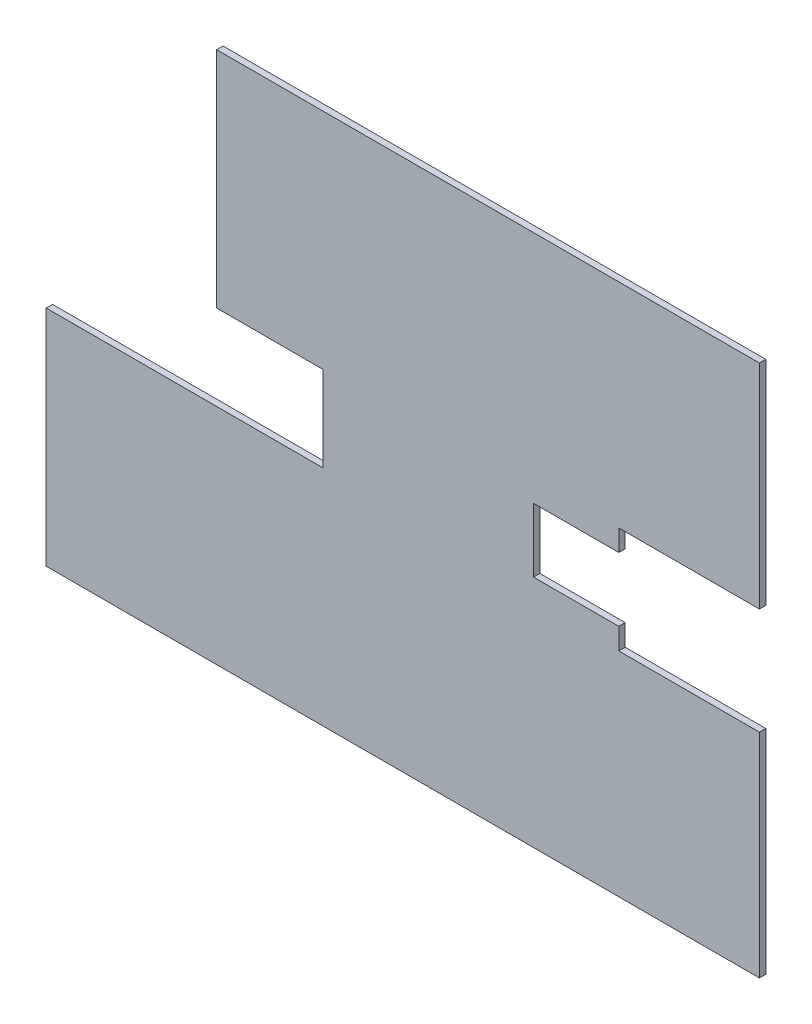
from build123d import *

# Parameters (mm, degrees)
BOSS_EXTRU_1_DEPTH = 3


with BuildPart() as part:
    # Esquisse1 → Boss.-Extru.1 (new body)
    with BuildSketch(Plane.XY):
        Polygon((-167.287619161, -124.920679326), (167.3938415, -124.920679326), (167.3938415, -25), (101.3938415, -25), (101.3938415, -15), (61.3938415, -15), (61.3938415, 15), (101.3938415, 15), (101.3938415, 25), (167.3938415, 25), (167.3938415, 125), (-87.287619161, 125), (-87.287619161, 20), (-37.287619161, 20), (-37.287619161, -20), (-167.287619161, -20), align=None)
    extrude(amount=BOSS_EXTRU_1_DEPTH)


solid = part.part
